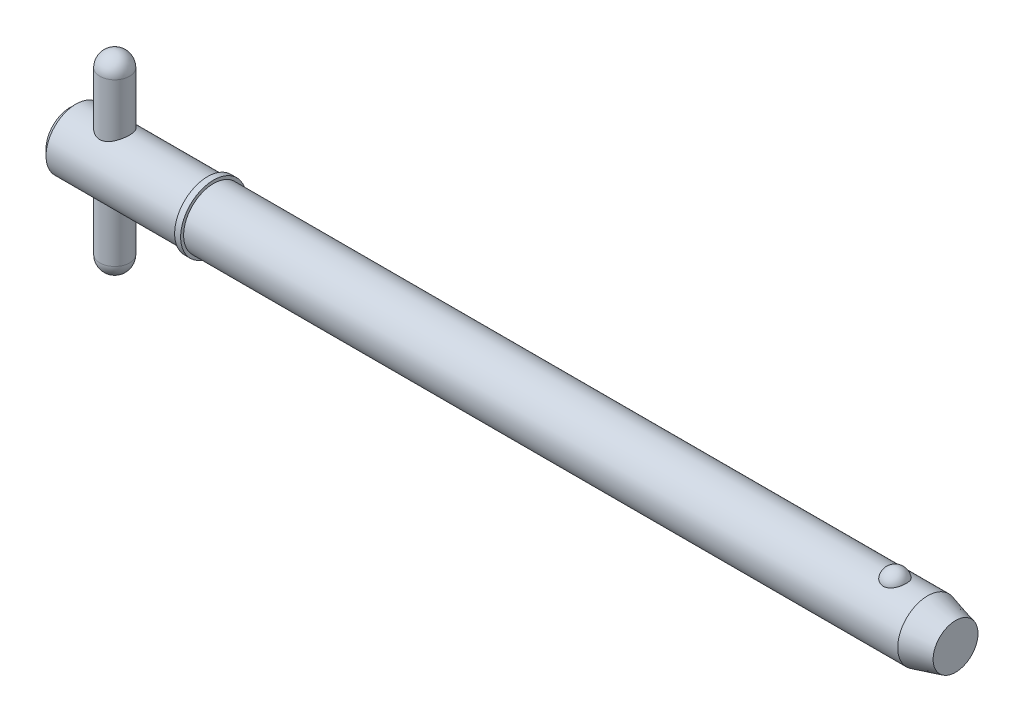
ISO-10303-21;
HEADER;
FILE_DESCRIPTION(('STEP AP214'),'2;1');
FILE_NAME('part.step','',(''),(''),'','','');
FILE_SCHEMA(('AUTOMOTIVE_DESIGN { 1 0 10303 214 1 1 1 1 }'));
ENDSEC;
DATA;
#1=APPLICATION_CONTEXT('core data for automotive mechanical design processes');
#2=APPLICATION_PROTOCOL_DEFINITION('international standard','automotive_design',2000,#1);
#3=PRODUCT_CONTEXT('',#1,'mechanical');
#4=PRODUCT('Part','Part','',(#3));
#5=PRODUCT_RELATED_PRODUCT_CATEGORY('part','',(#4));
#6=PRODUCT_DEFINITION_FORMATION('','',#4);
#7=PRODUCT_DEFINITION_CONTEXT('part definition',#1,'design');
#8=PRODUCT_DEFINITION('design','',#6,#7);
#9=PRODUCT_DEFINITION_SHAPE('','',#8);
#10=(LENGTH_UNIT() NAMED_UNIT(*) SI_UNIT(.MILLI.,.METRE.));
#11=(NAMED_UNIT(*) PLANE_ANGLE_UNIT() SI_UNIT($,.RADIAN.));
#12=(NAMED_UNIT(*) SI_UNIT($,.STERADIAN.) SOLID_ANGLE_UNIT());
#13=UNCERTAINTY_MEASURE_WITH_UNIT(LENGTH_MEASURE(1.E-05),#10,'distance_accuracy_value','');
#14=(GEOMETRIC_REPRESENTATION_CONTEXT(3) GLOBAL_UNCERTAINTY_ASSIGNED_CONTEXT((#13)) GLOBAL_UNIT_ASSIGNED_CONTEXT((#10,
#11,#12)) REPRESENTATION_CONTEXT('',''));
#15=CARTESIAN_POINT('',(0.,0.,0.));
#16=DIRECTION('',(0.,0.,1.));
#17=DIRECTION('',(1.,0.,0.));
#18=AXIS2_PLACEMENT_3D('',#15,#16,#17);
#19=CARTESIAN_POINT('',(5.94,12.7,0.));
#20=DIRECTION('',(0.,-1.,0.));
#21=DIRECTION('',(0.,0.,-1.));
#22=AXIS2_PLACEMENT_3D('',#19,#20,#21);
#23=CYLINDRICAL_SURFACE('',#22,1.98);
#24=CARTESIAN_POINT('',(5.94,-10.72,0.));
#25=DIRECTION('',(0.,-1.,0.));
#26=DIRECTION('',(0.,0.,-1.));
#27=AXIS2_PLACEMENT_3D('',#24,#25,#26);
#28=CIRCLE('',#27,1.98);
#29=CARTESIAN_POINT('',(5.94,-10.72,-1.98));
#30=VERTEX_POINT('',#29);
#31=EDGE_CURVE('P0_E10',#30,#30,#28,.F.);
#32=ORIENTED_EDGE('',*,*,#31,.T.);
#33=EDGE_LOOP('',(#32));
#34=FACE_BOUND('',#33,.T.);
#35=CARTESIAN_POINT('',(5.94,10.72,0.));
#36=DIRECTION('',(0.,-1.,0.));
#37=DIRECTION('',(0.,0.,-1.));
#38=AXIS2_PLACEMENT_3D('',#35,#36,#37);
#39=CIRCLE('',#38,1.98);
#40=CARTESIAN_POINT('',(5.94,10.72,-1.98));
#41=VERTEX_POINT('',#40);
#42=EDGE_CURVE('P0_E21',#41,#41,#39,.T.);
#43=ORIENTED_EDGE('',*,*,#42,.T.);
#44=EDGE_LOOP('',(#43));
#45=FACE_BOUND('',#44,.T.);
#46=ADVANCED_FACE('P0_F14',(#34,#45),#23,.T.);
#47=CARTESIAN_POINT('',(5.94,-10.72,0.));
#48=DIRECTION('',(0.,0.,1.));
#49=DIRECTION('',(1.,0.,0.));
#50=AXIS2_PLACEMENT_3D('',#47,#48,#49);
#51=SPHERICAL_SURFACE('',#50,1.98);
#52=CARTESIAN_POINT('',(5.94,-10.72,0.));
#53=DIRECTION('',(0.,-1.,0.));
#54=DIRECTION('',(0.,0.,-1.));
#55=AXIS2_PLACEMENT_3D('',#52,#53,#54);
#56=SPHERICAL_SURFACE('',#55,1.98);
#57=ORIENTED_EDGE('',*,*,#31,.F.);
#58=EDGE_LOOP('',(#57));
#59=FACE_BOUND('',#58,.T.);
#60=ADVANCED_FACE('P0_F29',(#59),#56,.T.);
#61=CARTESIAN_POINT('',(5.94,10.72,0.));
#62=DIRECTION('',(0.,0.,1.));
#63=DIRECTION('',(1.,0.,0.));
#64=AXIS2_PLACEMENT_3D('',#61,#62,#63);
#65=SPHERICAL_SURFACE('',#64,1.98);
#66=CARTESIAN_POINT('',(5.94,10.72,0.));
#67=DIRECTION('',(0.,-1.,0.));
#68=DIRECTION('',(0.,0.,-1.));
#69=AXIS2_PLACEMENT_3D('',#66,#67,#68);
#70=SPHERICAL_SURFACE('',#69,1.98);
#71=ORIENTED_EDGE('',*,*,#42,.F.);
#72=EDGE_LOOP('',(#71));
#73=FACE_BOUND('',#72,.T.);
#74=ADVANCED_FACE('P0_F16',(#73),#70,.T.);
#75=CLOSED_SHELL('',(#46,#60,#74));
#76=MANIFOLD_SOLID_BREP('P0_B1',#75);
#77=CARTESIAN_POINT('',(0.,0.,0.));
#78=DIRECTION('',(1.,0.,0.));
#79=DIRECTION('',(0.,0.,-1.));
#80=AXIS2_PLACEMENT_3D('',#77,#78,#79);
#81=CYLINDRICAL_SURFACE('',#80,3.97);
#82=CARTESIAN_POINT('',(113.775939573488,0.,0.));
#83=DIRECTION('',(1.,0.,0.));
#84=DIRECTION('',(0.,0.,-1.));
#85=AXIS2_PLACEMENT_3D('',#82,#83,#84);
#86=CIRCLE('',#85,3.97);
#87=CARTESIAN_POINT('',(113.775939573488,0.,-3.97));
#88=VERTEX_POINT('',#87);
#89=EDGE_CURVE('P1_E81',#88,#88,#86,.T.);
#90=ORIENTED_EDGE('',*,*,#89,.F.);
#91=EDGE_LOOP('',(#90));
#92=FACE_BOUND('',#91,.T.);
#93=CARTESIAN_POINT('',(19.05,0.,0.));
#94=DIRECTION('',(1.,0.,0.));
#95=DIRECTION('',(0.,0.,-1.));
#96=AXIS2_PLACEMENT_3D('',#93,#94,#95);
#97=CIRCLE('',#96,3.97);
#98=CARTESIAN_POINT('',(19.05,0.,-3.97));
#99=VERTEX_POINT('',#98);
#100=EDGE_CURVE('P1_E85',#99,#99,#97,.T.);
#101=ORIENTED_EDGE('',*,*,#100,.T.);
#102=EDGE_LOOP('',(#101));
#103=FACE_BOUND('',#102,.T.);
#104=CARTESIAN_POINT('',(109.445192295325,3.65715365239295,1.54470941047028));
#105=CARTESIAN_POINT('',(109.365244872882,3.65716001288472,1.54470290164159));
#106=CARTESIAN_POINT('',(109.285165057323,3.65987074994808,1.53832549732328));
#107=CARTESIAN_POINT('',(109.127237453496,3.6704221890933,1.51297018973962));
#108=CARTESIAN_POINT('',(109.04939614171,3.67827646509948,1.49395894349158));
#109=CARTESIAN_POINT('',(108.898461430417,3.69818848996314,1.44395950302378));
#110=CARTESIAN_POINT('',(108.825356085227,3.71023513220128,1.41300293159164));
#111=CARTESIAN_POINT('',(108.685563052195,3.73721833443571,1.34000212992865));
#112=CARTESIAN_POINT('',(108.618872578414,3.75215363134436,1.2979627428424));
#113=CARTESIAN_POINT('',(108.49148864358,3.78384968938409,1.20248834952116));
#114=CARTESIAN_POINT('',(108.431029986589,3.80065129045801,1.14875388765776));
#115=CARTESIAN_POINT('',(108.319694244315,3.83398532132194,1.03205417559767));
#116=CARTESIAN_POINT('',(108.268820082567,3.85051766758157,0.969086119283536));
#117=CARTESIAN_POINT('',(108.175632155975,3.88238608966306,0.832526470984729));
#118=CARTESIAN_POINT('',(108.133796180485,3.89763698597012,0.758588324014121));
#119=CARTESIAN_POINT('',(108.06251087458,3.92451063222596,0.60435211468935));
#120=CARTESIAN_POINT('',(108.033062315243,3.93613315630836,0.524053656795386));
#121=CARTESIAN_POINT('',(107.986892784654,3.95467606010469,0.358403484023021));
#122=CARTESIAN_POINT('',(107.970312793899,3.96154426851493,0.273006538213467));
#123=CARTESIAN_POINT('',(107.950756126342,3.96967008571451,0.100408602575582));
#124=CARTESIAN_POINT('',(107.947778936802,3.97092790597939,0.0132076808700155));
#125=CARTESIAN_POINT('',(107.955458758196,3.96771794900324,-0.159844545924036));
#126=CARTESIAN_POINT('',(107.966016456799,3.96329187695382,-0.245701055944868));
#127=CARTESIAN_POINT('',(108.00038009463,3.94923163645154,-0.41427746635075));
#128=CARTESIAN_POINT('',(108.024186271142,3.93959737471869,-0.496997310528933));
#129=CARTESIAN_POINT('',(108.08461142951,3.91607752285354,-0.657113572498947));
#130=CARTESIAN_POINT('',(108.121249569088,3.90218558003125,-0.734501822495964));
#131=CARTESIAN_POINT('',(108.206593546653,3.87158287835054,-0.881704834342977));
#132=CARTESIAN_POINT('',(108.255300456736,3.8548718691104,-0.951518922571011));
#133=CARTESIAN_POINT('',(108.364116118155,3.82028735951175,-1.08208159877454));
#134=CARTESIAN_POINT('',(108.424295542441,3.80240713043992,-1.14276958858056));
#135=CARTESIAN_POINT('',(108.554493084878,3.76758161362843,-1.2528243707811));
#136=CARTESIAN_POINT('',(108.624510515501,3.75063626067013,-1.30219195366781));
#137=CARTESIAN_POINT('',(108.77118160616,3.71998948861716,-1.38729709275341));
#138=CARTESIAN_POINT('',(108.847681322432,3.70623183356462,-1.42327904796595));
#139=CARTESIAN_POINT('',(109.006298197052,3.68323188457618,-1.48178996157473));
#140=CARTESIAN_POINT('',(109.0884132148,3.67398788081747,-1.5043240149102));
#141=CARTESIAN_POINT('',(109.251481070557,3.6615216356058,-1.53440939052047));
#142=CARTESIAN_POINT('',(109.332284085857,3.65801951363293,-1.54265826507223));
#143=CARTESIAN_POINT('',(109.49420850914,3.65657341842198,-1.54608423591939));
#144=CARTESIAN_POINT('',(109.575329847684,3.65862829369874,-1.54126404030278));
#145=CARTESIAN_POINT('',(109.732812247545,3.66788969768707,-1.51908474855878));
#146=CARTESIAN_POINT('',(109.809242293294,3.67492621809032,-1.50213925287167));
#147=CARTESIAN_POINT('',(109.958041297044,3.69318404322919,-1.45666982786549));
#148=CARTESIAN_POINT('',(110.030409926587,3.70440568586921,-1.42814496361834));
#149=CARTESIAN_POINT('',(110.170802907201,3.73012749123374,-1.35956319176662));
#150=CARTESIAN_POINT('',(110.238700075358,3.74469307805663,-1.31927107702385));
#151=CARTESIAN_POINT('',(110.366864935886,3.77545272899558,-1.22847440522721));
#152=CARTESIAN_POINT('',(110.427130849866,3.79164717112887,-1.17796747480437));
#153=CARTESIAN_POINT('',(110.541634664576,3.82490325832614,-1.06519260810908));
#154=CARTESIAN_POINT('',(110.595413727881,3.84196735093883,-1.00245914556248));
#155=CARTESIAN_POINT('',(110.692098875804,3.87439863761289,-0.868715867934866));
#156=CARTESIAN_POINT('',(110.735003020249,3.88976552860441,-0.797704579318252));
#157=CARTESIAN_POINT('',(110.810266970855,3.91771381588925,-0.646896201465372));
#158=CARTESIAN_POINT('',(110.84225322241,3.93019255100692,-0.566893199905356));
#159=CARTESIAN_POINT('',(110.893110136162,3.95043886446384,-0.402255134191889));
#160=CARTESIAN_POINT('',(110.911980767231,3.95820643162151,-0.317620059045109));
#161=CARTESIAN_POINT('',(110.93621625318,3.96823733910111,-0.146156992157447));
#162=CARTESIAN_POINT('',(110.941587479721,3.970503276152,-0.0593300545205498));
#163=CARTESIAN_POINT('',(110.938730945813,3.96930811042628,0.114057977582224));
#164=CARTESIAN_POINT('',(110.930503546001,3.9658471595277,0.200619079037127));
#165=CARTESIAN_POINT('',(110.900706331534,3.95358562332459,0.370506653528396));
#166=CARTESIAN_POINT('',(110.87921294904,3.94481563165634,0.453848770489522));
#167=CARTESIAN_POINT('',(110.82338397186,3.92284586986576,0.615497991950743));
#168=CARTESIAN_POINT('',(110.789047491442,3.90964579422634,0.693804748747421));
#169=CARTESIAN_POINT('',(110.707970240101,3.88006987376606,0.843703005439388));
#170=CARTESIAN_POINT('',(110.661153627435,3.86367478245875,0.915249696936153));
#171=CARTESIAN_POINT('',(110.556189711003,3.82949741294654,1.04910810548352));
#172=CARTESIAN_POINT('',(110.498042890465,3.81171519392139,1.11142021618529));
#173=CARTESIAN_POINT('',(110.371743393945,3.77673366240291,1.22503948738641));
#174=CARTESIAN_POINT('',(110.303597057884,3.75953398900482,1.27635357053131));
#175=CARTESIAN_POINT('',(110.158900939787,3.72770506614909,1.36653336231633));
#176=CARTESIAN_POINT('',(110.082348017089,3.71307678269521,1.40539439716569));
#177=CARTESIAN_POINT('',(109.925759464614,3.68864287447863,1.46830480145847));
#178=CARTESIAN_POINT('',(109.845930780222,3.67869017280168,1.49281289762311));
#179=CARTESIAN_POINT('',(109.682987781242,3.66414535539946,1.52817474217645));
#180=CARTESIAN_POINT('',(109.599884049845,3.65953723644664,1.53906926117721));
#181=CARTESIAN_POINT('',(109.492776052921,3.6573894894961,1.54414878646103));
#182=CARTESIAN_POINT('',(109.468990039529,3.65715175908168,1.54471134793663));
#183=CARTESIAN_POINT('',(109.445192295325,3.65715365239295,1.54470941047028));
#184=B_SPLINE_CURVE_WITH_KNOTS('',3,(#104,#105,#106,#107,#108,#109,#110,#111,#112,#113,#114,
#115,#116,#117,#118,#119,#120,#121,#122,#123,#124,#125,#126,#127,#128,#129,#130,#131,#132,#133,
#134,#135,#136,#137,#138,#139,#140,#141,#142,#143,#144,#145,#146,#147,#148,#149,#150,#151,#152,
#153,#154,#155,#156,#157,#158,#159,#160,#161,#162,#163,#164,#165,#166,#167,#168,#169,#170,#171,
#172,#173,#174,#175,#176,#177,#178,#179,#180,#181,#182,#183),.UNSPECIFIED.,.T.,.F.,(4,2,2,2,2,2,
2,2,2,2,2,2,2,2,2,2,2,2,2,2,2,2,2,2,2,2,2,2,2,2,2,2,2,2,2,2,2,2,2,4),(0.,0.239777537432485,
0.480190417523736,0.719971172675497,0.959647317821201,1.20639040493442,1.45320863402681,
1.7109367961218,1.96868099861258,2.22921052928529,2.48973023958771,2.74834928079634,
3.00697295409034,3.26598440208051,3.52501886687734,3.78570385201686,4.04637062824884,
4.30201257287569,4.5575576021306,4.80022994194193,5.04285200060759,5.27757006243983,
5.51230707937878,5.75210128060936,5.99195126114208,6.24392810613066,6.49594987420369,
6.75588818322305,7.01582710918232,7.27564332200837,7.53545264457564,7.79377886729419,
8.0521229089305,8.31207418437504,8.57201437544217,8.83179046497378,9.09166393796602,
9.34270057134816,9.59298357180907,9.66435753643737),.UNSPECIFIED.);
#185=CARTESIAN_POINT('',(109.445192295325,3.65715365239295,1.54470941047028));
#186=VERTEX_POINT('',#185);
#187=EDGE_CURVE('P1_E35',#186,#186,#184,.T.);
#188=ORIENTED_EDGE('',*,*,#187,.T.);
#189=EDGE_LOOP('',(#188));
#190=FACE_BOUND('',#189,.T.);
#191=ADVANCED_FACE('P1_F13',(#92,#103,#190),#81,.T.);
#192=CARTESIAN_POINT('',(0.,0.,0.));
#193=DIRECTION('',(-1.,0.,0.));
#194=DIRECTION('',(0.,0.,1.));
#195=AXIS2_PLACEMENT_3D('',#192,#193,#194);
#196=PLANE('',#195);
#197=CARTESIAN_POINT('',(0.,0.,0.));
#198=DIRECTION('',(1.,0.,0.));
#199=DIRECTION('',(0.,0.,-1.));
#200=AXIS2_PLACEMENT_3D('',#197,#198,#199);
#201=CIRCLE('',#200,3.176);
#202=CARTESIAN_POINT('',(0.,0.,-3.176));
#203=VERTEX_POINT('',#202);
#204=EDGE_CURVE('P1_E9',#203,#203,#201,.T.);
#205=ORIENTED_EDGE('',*,*,#204,.F.);
#206=EDGE_LOOP('',(#205));
#207=FACE_BOUND('',#206,.T.);
#208=ADVANCED_FACE('P1_F15',(#207),#196,.T.);
#209=CARTESIAN_POINT('',(0.793999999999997,0.,0.));
#210=DIRECTION('',(1.,0.,0.));
#211=DIRECTION('',(0.,0.,-1.));
#212=AXIS2_PLACEMENT_3D('',#209,#210,#211);
#213=CONICAL_SURFACE('',#212,3.97,0.78539816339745);
#214=ORIENTED_EDGE('',*,*,#204,.T.);
#215=EDGE_LOOP('',(#214));
#216=FACE_BOUND('',#215,.T.);
#217=CARTESIAN_POINT('',(0.793999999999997,0.,0.));
#218=DIRECTION('',(1.,0.,0.));
#219=DIRECTION('',(0.,0.,-1.));
#220=AXIS2_PLACEMENT_3D('',#217,#218,#219);
#221=CIRCLE('',#220,3.97);
#222=CARTESIAN_POINT('',(0.793999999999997,0.,-3.97));
#223=VERTEX_POINT('',#222);
#224=EDGE_CURVE('P1_E26',#223,#223,#221,.T.);
#225=ORIENTED_EDGE('',*,*,#224,.F.);
#226=EDGE_LOOP('',(#225));
#227=FACE_BOUND('',#226,.T.);
#228=ADVANCED_FACE('P1_F77',(#216,#227),#213,.T.);
#229=CARTESIAN_POINT('',(0.,0.,0.));
#230=DIRECTION('',(1.,0.,0.));
#231=DIRECTION('',(0.,0.,-1.));
#232=AXIS2_PLACEMENT_3D('',#229,#230,#231);
#233=CYLINDRICAL_SURFACE('',#232,3.97);
#234=CARTESIAN_POINT('',(5.94,-3.44100276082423,1.98));
#235=CARTESIAN_POINT('',(5.8367885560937,-3.44101282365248,1.97999171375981));
#236=CARTESIAN_POINT('',(5.73344176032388,-3.44571749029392,1.97187534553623));
#237=CARTESIAN_POINT('',(5.52991905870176,-3.46385873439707,1.93981946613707));
#238=CARTESIAN_POINT('',(5.42975031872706,-3.47731375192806,1.91584653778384));
#239=CARTESIAN_POINT('',(5.23590869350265,-3.51100678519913,1.85336773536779));
#240=CARTESIAN_POINT('',(5.14220446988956,-3.53120882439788,1.81493880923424));
#241=CARTESIAN_POINT('',(4.9625969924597,-3.57606420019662,1.72487335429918));
#242=CARTESIAN_POINT('',(4.87669412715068,-3.6007177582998,1.67323616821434));
#243=CARTESIAN_POINT('',(4.70734412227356,-3.65417020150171,1.55325205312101));
#244=CARTESIAN_POINT('',(4.62467662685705,-3.68314323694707,1.4838818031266));
#245=CARTESIAN_POINT('',(4.47154355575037,-3.74056406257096,1.33252902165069));
#246=CARTESIAN_POINT('',(4.40108404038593,-3.76901158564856,1.25054026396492));
#247=CARTESIAN_POINT('',(4.26974803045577,-3.82445556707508,1.06956584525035));
#248=CARTESIAN_POINT('',(4.20982960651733,-3.8512271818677,0.969809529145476));
#249=CARTESIAN_POINT('',(4.10798077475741,-3.89804342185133,0.760047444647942));
#250=CARTESIAN_POINT('',(4.06603907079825,-3.91809226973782,0.650048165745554));
#251=CARTESIAN_POINT('',(4.00441878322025,-3.94794912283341,0.431181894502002));
#252=CARTESIAN_POINT('',(3.98337329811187,-3.95838209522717,0.322786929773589));
#253=CARTESIAN_POINT('',(3.9596425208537,-3.97016407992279,0.103541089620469));
#254=CARTESIAN_POINT('',(3.95694618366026,-3.97151855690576,-0.00730826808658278));
#255=CARTESIAN_POINT('',(3.9694599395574,-3.96528826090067,-0.218044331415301));
#256=CARTESIAN_POINT('',(3.98314071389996,-3.95846689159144,-0.318049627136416));
#257=CARTESIAN_POINT('',(4.02528522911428,-3.93780347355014,-0.514124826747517));
#258=CARTESIAN_POINT('',(4.05375007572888,-3.92396089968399,-0.61019443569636));
#259=CARTESIAN_POINT('',(4.12484256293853,-3.89028355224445,-0.797351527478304));
#260=CARTESIAN_POINT('',(4.16766142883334,-3.87036821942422,-0.888351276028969));
#261=CARTESIAN_POINT('',(4.26598377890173,-3.82634285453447,-1.06209448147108));
#262=CARTESIAN_POINT('',(4.32149181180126,-3.8022313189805,-1.14483496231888));
#263=CARTESIAN_POINT('',(4.44962332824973,-3.74940011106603,-1.30802500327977));
#264=CARTESIAN_POINT('',(4.52336636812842,-3.72046031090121,-1.38752498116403));
#265=CARTESIAN_POINT('',(4.68287656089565,-3.66269463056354,-1.53354043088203));
#266=CARTESIAN_POINT('',(4.7686527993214,-3.63386885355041,-1.60004599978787));
#267=CARTESIAN_POINT('',(4.9564069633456,-3.57763161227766,-1.72228426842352));
#268=CARTESIAN_POINT('',(5.05906485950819,-3.5504233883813,-1.77707534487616));
#269=CARTESIAN_POINT('',(5.27381412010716,-3.50334038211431,-1.86819784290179));
#270=CARTESIAN_POINT('',(5.38589553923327,-3.48345798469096,-1.90454844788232));
#271=CARTESIAN_POINT('',(5.6069795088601,-3.45548331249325,-1.95481643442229));
#272=CARTESIAN_POINT('',(5.71552407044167,-3.44658268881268,-1.97028113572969));
#273=CARTESIAN_POINT('',(5.93399639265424,-3.43928114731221,-1.98300600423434));
#274=CARTESIAN_POINT('',(6.04392313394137,-3.44087289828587,-1.98027888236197));
#275=CARTESIAN_POINT('',(6.24931618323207,-3.45351901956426,-1.95811780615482));
#276=CARTESIAN_POINT('',(6.34505668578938,-3.46352725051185,-1.94052989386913));
#277=CARTESIAN_POINT('',(6.53204702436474,-3.49033612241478,-1.89188242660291));
#278=CARTESIAN_POINT('',(6.62329540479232,-3.50713894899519,-1.86081853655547));
#279=CARTESIAN_POINT('',(6.80352105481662,-3.54655680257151,-1.78458666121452));
#280=CARTESIAN_POINT('',(6.89219712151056,-3.56940508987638,-1.73883178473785));
#281=CARTESIAN_POINT('',(7.06112449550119,-3.61813012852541,-1.63502913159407));
#282=CARTESIAN_POINT('',(7.14137144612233,-3.6440084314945,-1.57697504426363));
#283=CARTESIAN_POINT('',(7.30168083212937,-3.69977514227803,-1.44171920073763));
#284=CARTESIAN_POINT('',(7.38046039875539,-3.7297597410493,-1.36302972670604));
#285=CARTESIAN_POINT('',(7.52409649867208,-3.78754991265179,-1.19307190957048));
#286=CARTESIAN_POINT('',(7.58894840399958,-3.81535475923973,-1.10179940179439));
#287=CARTESIAN_POINT('',(7.70430122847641,-3.86658972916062,-0.906019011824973));
#288=CARTESIAN_POINT('',(7.75438714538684,-3.88988795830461,-0.801229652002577));
#289=CARTESIAN_POINT('',(7.83572184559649,-3.92848199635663,-0.583216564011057));
#290=CARTESIAN_POINT('',(7.86698708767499,-3.94378479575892,-0.470000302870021));
#291=CARTESIAN_POINT('',(7.90711051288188,-3.96355307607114,-0.249525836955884));
#292=CARTESIAN_POINT('',(7.91775648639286,-3.96888171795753,-0.142669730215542));
#293=CARTESIAN_POINT('',(7.92160247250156,-3.97079858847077,0.0714191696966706));
#294=CARTESIAN_POINT('',(7.91480852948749,-3.96738984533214,0.178651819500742));
#295=CARTESIAN_POINT('',(7.88515479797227,-3.9527181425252,0.383072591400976));
#296=CARTESIAN_POINT('',(7.8633739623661,-3.94198303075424,0.480459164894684));
#297=CARTESIAN_POINT('',(7.80581513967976,-3.91422178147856,0.670038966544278));
#298=CARTESIAN_POINT('',(7.77003513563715,-3.89719473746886,0.762231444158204));
#299=CARTESIAN_POINT('',(7.68389191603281,-3.85747818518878,0.943248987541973));
#300=CARTESIAN_POINT('',(7.63296879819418,-3.83457704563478,1.03175978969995));
#301=CARTESIAN_POINT('',(7.51869140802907,-3.7855122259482,1.19934744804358));
#302=CARTESIAN_POINT('',(7.45533142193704,-3.75934704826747,1.2784199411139));
#303=CARTESIAN_POINT('',(7.31068939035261,-3.70329841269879,1.433144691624));
#304=CARTESIAN_POINT('',(7.22825362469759,-3.67330340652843,1.50768183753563));
#305=CARTESIAN_POINT('',(7.05162367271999,-3.61514025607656,1.64226879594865));
#306=CARTESIAN_POINT('',(6.95741928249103,-3.58697372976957,1.70230590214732));
#307=CARTESIAN_POINT('',(6.75590859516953,-3.53504049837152,1.80775364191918));
#308=CARTESIAN_POINT('',(6.64828786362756,-3.51143624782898,1.85265616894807));
#309=CARTESIAN_POINT('',(6.48137774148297,-3.48289659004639,1.90544537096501));
#310=CARTESIAN_POINT('',(6.42488151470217,-3.4745323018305,1.9206071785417));
#311=CARTESIAN_POINT('',(6.31046920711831,-3.4604244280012,1.94591259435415));
#312=CARTESIAN_POINT('',(6.25255415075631,-3.45467900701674,1.95605971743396));
#313=CARTESIAN_POINT('',(6.1521444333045,-3.44728060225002,1.96905939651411));
#314=CARTESIAN_POINT('',(6.10985721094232,-3.44493297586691,1.97315742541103));
#315=CARTESIAN_POINT('',(6.02505433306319,-3.44179192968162,1.97862952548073));
#316=CARTESIAN_POINT('',(5.98253866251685,-3.44099861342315,1.98000341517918));
#317=CARTESIAN_POINT('',(5.94,-3.44100276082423,1.98));
#318=B_SPLINE_CURVE_WITH_KNOTS('',3,(#234,#235,#236,#237,#238,#239,#240,#241,#242,#243,#244,
#245,#246,#247,#248,#249,#250,#251,#252,#253,#254,#255,#256,#257,#258,#259,#260,#261,#262,#263,
#264,#265,#266,#267,#268,#269,#270,#271,#272,#273,#274,#275,#276,#277,#278,#279,#280,#281,#282,
#283,#284,#285,#286,#287,#288,#289,#290,#291,#292,#293,#294,#295,#296,#297,#298,#299,#300,#301,
#302,#303,#304,#305,#306,#307,#308,#309,#310,#311,#312,#313,#314,#315,#316,#317),.UNSPECIFIED.,
.T.,.F.,(4,2,2,2,2,2,2,2,2,2,2,2,2,2,2,2,2,2,2,2,2,2,2,2,2,2,2,2,2,2,2,2,2,2,2,2,2,2,2,2,2,4),
(0.,0.309462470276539,0.619579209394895,0.928068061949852,1.23657226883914,1.57038619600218,
1.90436536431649,2.26071614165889,2.61684266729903,2.94773555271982,3.27842924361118,
3.58050679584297,3.88260694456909,4.18890317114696,4.49530936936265,4.83057163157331,
5.1660884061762,5.52272472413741,5.87898927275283,6.20706708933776,6.53491569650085,
6.82716910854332,7.11951660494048,7.42541184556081,7.73146442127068,8.07586334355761,
8.42037652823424,8.77380887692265,9.12693169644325,9.44775848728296,9.76847409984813,
10.0682302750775,10.3680296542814,10.6806938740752,10.9935020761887,11.3373031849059,
11.6814044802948,12.0361164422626,12.2131519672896,12.3900632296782,12.5175998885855,
12.6451450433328),.UNSPECIFIED.);
#319=CARTESIAN_POINT('',(5.94,-3.44100276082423,1.98));
#320=VERTEX_POINT('',#319);
#321=EDGE_CURVE('P1_E17',#320,#320,#318,.T.);
#322=ORIENTED_EDGE('',*,*,#321,.F.);
#323=EDGE_LOOP('',(#322));
#324=FACE_BOUND('',#323,.T.);
#325=CARTESIAN_POINT('',(5.94,3.44100276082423,1.98));
#326=CARTESIAN_POINT('',(6.0432114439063,3.44101282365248,1.97999171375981));
#327=CARTESIAN_POINT('',(6.14655823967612,3.44571749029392,1.97187534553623));
#328=CARTESIAN_POINT('',(6.35008094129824,3.46385873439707,1.93981946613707));
#329=CARTESIAN_POINT('',(6.45024968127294,3.47731375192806,1.91584653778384));
#330=CARTESIAN_POINT('',(6.64409130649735,3.51100678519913,1.85336773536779));
#331=CARTESIAN_POINT('',(6.73779553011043,3.53120882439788,1.81493880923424));
#332=CARTESIAN_POINT('',(6.91740300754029,3.57606420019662,1.72487335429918));
#333=CARTESIAN_POINT('',(7.00330587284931,3.6007177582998,1.67323616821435));
#334=CARTESIAN_POINT('',(7.17265587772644,3.65417020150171,1.55325205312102));
#335=CARTESIAN_POINT('',(7.25532337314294,3.68314323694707,1.4838818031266));
#336=CARTESIAN_POINT('',(7.40845644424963,3.74056406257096,1.3325290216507));
#337=CARTESIAN_POINT('',(7.47891595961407,3.76901158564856,1.25054026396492));
#338=CARTESIAN_POINT('',(7.61025196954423,3.82445556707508,1.06956584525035));
#339=CARTESIAN_POINT('',(7.67017039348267,3.8512271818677,0.969809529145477));
#340=CARTESIAN_POINT('',(7.77201922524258,3.89804342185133,0.760047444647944));
#341=CARTESIAN_POINT('',(7.81396092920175,3.91809226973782,0.650048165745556));
#342=CARTESIAN_POINT('',(7.87558121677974,3.94794912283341,0.431181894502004));
#343=CARTESIAN_POINT('',(7.89662670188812,3.95838209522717,0.322786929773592));
#344=CARTESIAN_POINT('',(7.9203574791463,3.97016407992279,0.103541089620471));
#345=CARTESIAN_POINT('',(7.92305381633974,3.97151855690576,-0.00730826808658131));
#346=CARTESIAN_POINT('',(7.9105400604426,3.96528826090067,-0.2180443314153));
#347=CARTESIAN_POINT('',(7.89685928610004,3.95846689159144,-0.318049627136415));
#348=CARTESIAN_POINT('',(7.85471477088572,3.93780347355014,-0.514124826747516));
#349=CARTESIAN_POINT('',(7.82624992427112,3.92396089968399,-0.61019443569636));
#350=CARTESIAN_POINT('',(7.75515743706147,3.89028355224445,-0.797351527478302));
#351=CARTESIAN_POINT('',(7.71233857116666,3.87036821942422,-0.888351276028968));
#352=CARTESIAN_POINT('',(7.61401622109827,3.82634285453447,-1.06209448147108));
#353=CARTESIAN_POINT('',(7.55850818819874,3.8022313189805,-1.14483496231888));
#354=CARTESIAN_POINT('',(7.43037667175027,3.74940011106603,-1.30802500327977));
#355=CARTESIAN_POINT('',(7.35663363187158,3.72046031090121,-1.38752498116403));
#356=CARTESIAN_POINT('',(7.19712343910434,3.66269463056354,-1.53354043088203));
#357=CARTESIAN_POINT('',(7.1113472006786,3.63386885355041,-1.60004599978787));
#358=CARTESIAN_POINT('',(6.9235930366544,3.57763161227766,-1.72228426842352));
#359=CARTESIAN_POINT('',(6.82093514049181,3.5504233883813,-1.77707534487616));
#360=CARTESIAN_POINT('',(6.60618587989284,3.50334038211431,-1.86819784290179));
#361=CARTESIAN_POINT('',(6.49410446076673,3.48345798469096,-1.90454844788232));
#362=CARTESIAN_POINT('',(6.2730204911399,3.45548331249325,-1.95481643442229));
#363=CARTESIAN_POINT('',(6.16447592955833,3.44658268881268,-1.97028113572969));
#364=CARTESIAN_POINT('',(5.94600360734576,3.43928114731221,-1.98300600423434));
#365=CARTESIAN_POINT('',(5.83607686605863,3.44087289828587,-1.98027888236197));
#366=CARTESIAN_POINT('',(5.63068381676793,3.45351901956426,-1.95811780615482));
#367=CARTESIAN_POINT('',(5.53494331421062,3.46352725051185,-1.94052989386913));
#368=CARTESIAN_POINT('',(5.34795297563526,3.49033612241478,-1.89188242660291));
#369=CARTESIAN_POINT('',(5.25670459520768,3.50713894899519,-1.86081853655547));
#370=CARTESIAN_POINT('',(5.07647894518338,3.54655680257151,-1.78458666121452));
#371=CARTESIAN_POINT('',(4.98780287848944,3.56940508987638,-1.73883178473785));
#372=CARTESIAN_POINT('',(4.81887550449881,3.61813012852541,-1.63502913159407));
#373=CARTESIAN_POINT('',(4.73862855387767,3.6440084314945,-1.57697504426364));
#374=CARTESIAN_POINT('',(4.57831916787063,3.69977514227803,-1.44171920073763));
#375=CARTESIAN_POINT('',(4.49953960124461,3.7297597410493,-1.36302972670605));
#376=CARTESIAN_POINT('',(4.35590350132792,3.78754991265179,-1.19307190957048));
#377=CARTESIAN_POINT('',(4.29105159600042,3.81535475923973,-1.10179940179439));
#378=CARTESIAN_POINT('',(4.17569877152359,3.86658972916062,-0.906019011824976));
#379=CARTESIAN_POINT('',(4.12561285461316,3.88988795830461,-0.80122965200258));
#380=CARTESIAN_POINT('',(4.04427815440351,3.92848199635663,-0.58321656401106));
#381=CARTESIAN_POINT('',(4.01301291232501,3.94378479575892,-0.470000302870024));
#382=CARTESIAN_POINT('',(3.97288948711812,3.96355307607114,-0.249525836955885));
#383=CARTESIAN_POINT('',(3.96224351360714,3.96888171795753,-0.142669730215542));
#384=CARTESIAN_POINT('',(3.95839752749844,3.97079858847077,0.0714191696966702));
#385=CARTESIAN_POINT('',(3.96519147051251,3.96738984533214,0.178651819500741));
#386=CARTESIAN_POINT('',(3.99484520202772,3.9527181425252,0.383072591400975));
#387=CARTESIAN_POINT('',(4.01662603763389,3.94198303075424,0.480459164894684));
#388=CARTESIAN_POINT('',(4.07418486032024,3.91422178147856,0.670038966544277));
#389=CARTESIAN_POINT('',(4.10996486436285,3.89719473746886,0.762231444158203));
#390=CARTESIAN_POINT('',(4.19610808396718,3.85747818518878,0.943248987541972));
#391=CARTESIAN_POINT('',(4.24703120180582,3.83457704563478,1.03175978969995));
#392=CARTESIAN_POINT('',(4.36130859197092,3.7855122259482,1.19934744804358));
#393=CARTESIAN_POINT('',(4.42466857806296,3.75934704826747,1.2784199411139));
#394=CARTESIAN_POINT('',(4.56931060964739,3.70329841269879,1.433144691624));
#395=CARTESIAN_POINT('',(4.65174637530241,3.67330340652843,1.50768183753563));
#396=CARTESIAN_POINT('',(4.82837632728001,3.61514025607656,1.64226879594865));
#397=CARTESIAN_POINT('',(4.92258071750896,3.58697372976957,1.70230590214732));
#398=CARTESIAN_POINT('',(5.12409140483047,3.53504049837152,1.80775364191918));
#399=CARTESIAN_POINT('',(5.23171213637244,3.51143624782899,1.85265616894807));
#400=CARTESIAN_POINT('',(5.39862225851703,3.48289659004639,1.90544537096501));
#401=CARTESIAN_POINT('',(5.45511848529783,3.4745323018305,1.9206071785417));
#402=CARTESIAN_POINT('',(5.56953079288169,3.4604244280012,1.94591259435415));
#403=CARTESIAN_POINT('',(5.62744584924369,3.45467900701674,1.95605971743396));
#404=CARTESIAN_POINT('',(5.7278555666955,3.44728060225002,1.9690593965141));
#405=CARTESIAN_POINT('',(5.77014278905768,3.44493297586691,1.97315742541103));
#406=CARTESIAN_POINT('',(5.85494566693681,3.44179192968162,1.97862952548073));
#407=CARTESIAN_POINT('',(5.89746133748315,3.44099861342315,1.98000341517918));
#408=CARTESIAN_POINT('',(5.94,3.44100276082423,1.98));
#409=B_SPLINE_CURVE_WITH_KNOTS('',3,(#325,#326,#327,#328,#329,#330,#331,#332,#333,#334,#335,
#336,#337,#338,#339,#340,#341,#342,#343,#344,#345,#346,#347,#348,#349,#350,#351,#352,#353,#354,
#355,#356,#357,#358,#359,#360,#361,#362,#363,#364,#365,#366,#367,#368,#369,#370,#371,#372,#373,
#374,#375,#376,#377,#378,#379,#380,#381,#382,#383,#384,#385,#386,#387,#388,#389,#390,#391,#392,
#393,#394,#395,#396,#397,#398,#399,#400,#401,#402,#403,#404,#405,#406,#407,#408),.UNSPECIFIED.,
.T.,.F.,(4,2,2,2,2,2,2,2,2,2,2,2,2,2,2,2,2,2,2,2,2,2,2,2,2,2,2,2,2,2,2,2,2,2,2,2,2,2,2,2,2,4),
(0.,0.309462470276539,0.619579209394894,0.928068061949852,1.23657226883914,1.57038619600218,
1.90436536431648,2.26071614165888,2.61684266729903,2.94773555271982,3.27842924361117,
3.58050679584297,3.88260694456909,4.18890317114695,4.49530936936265,4.83057163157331,
5.1660884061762,5.5227247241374,5.87898927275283,6.20706708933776,6.53491569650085,
6.82716910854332,7.11951660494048,7.42541184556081,7.73146442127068,8.07586334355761,
8.42037652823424,8.77380887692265,9.12693169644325,9.44775848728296,9.76847409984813,
10.0682302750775,10.3680296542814,10.6806938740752,10.9935020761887,11.3373031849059,
11.6814044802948,12.0361164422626,12.2131519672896,12.3900632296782,12.5175998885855,
12.6451450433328),.UNSPECIFIED.);
#410=CARTESIAN_POINT('',(5.94,3.44100276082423,1.98));
#411=VERTEX_POINT('',#410);
#412=EDGE_CURVE('P1_E43',#411,#411,#409,.T.);
#413=ORIENTED_EDGE('',*,*,#412,.F.);
#414=EDGE_LOOP('',(#413));
#415=FACE_BOUND('',#414,.T.);
#416=ORIENTED_EDGE('',*,*,#224,.T.);
#417=EDGE_LOOP('',(#416));
#418=FACE_BOUND('',#417,.T.);
#419=CARTESIAN_POINT('',(18.256,0.,0.));
#420=DIRECTION('',(1.,0.,0.));
#421=DIRECTION('',(0.,0.,-1.));
#422=AXIS2_PLACEMENT_3D('',#419,#420,#421);
#423=CIRCLE('',#422,3.97);
#424=CARTESIAN_POINT('',(18.256,0.,-3.97));
#425=VERTEX_POINT('',#424);
#426=EDGE_CURVE('P1_E31',#425,#425,#423,.T.);
#427=ORIENTED_EDGE('',*,*,#426,.F.);
#428=EDGE_LOOP('',(#427));
#429=FACE_BOUND('',#428,.T.);
#430=ADVANCED_FACE('P1_F103',(#324,#415,#418,#429),#233,.T.);
#431=CARTESIAN_POINT('',(18.256,3.97,0.));
#432=DIRECTION('',(-1.,0.,0.));
#433=DIRECTION('',(0.,0.,1.));
#434=AXIS2_PLACEMENT_3D('',#431,#432,#433);
#435=PLANE('',#434);
#436=ORIENTED_EDGE('',*,*,#426,.T.);
#437=EDGE_LOOP('',(#436));
#438=FACE_BOUND('',#437,.T.);
#439=CARTESIAN_POINT('',(18.256,0.,0.));
#440=DIRECTION('',(1.,0.,0.));
#441=DIRECTION('',(0.,0.,-1.));
#442=AXIS2_PLACEMENT_3D('',#439,#440,#441);
#443=CIRCLE('',#442,4.367);
#444=CARTESIAN_POINT('',(18.256,0.,-4.367));
#445=VERTEX_POINT('',#444);
#446=EDGE_CURVE('P1_E91',#445,#445,#443,.T.);
#447=ORIENTED_EDGE('',*,*,#446,.F.);
#448=EDGE_LOOP('',(#447));
#449=FACE_BOUND('',#448,.T.);
#450=ADVANCED_FACE('P1_F100',(#438,#449),#435,.T.);
#451=CARTESIAN_POINT('',(0.,0.,0.));
#452=DIRECTION('',(1.,0.,0.));
#453=DIRECTION('',(0.,0.,-1.));
#454=AXIS2_PLACEMENT_3D('',#451,#452,#453);
#455=CYLINDRICAL_SURFACE('',#454,4.367);
#456=ORIENTED_EDGE('',*,*,#446,.T.);
#457=EDGE_LOOP('',(#456));
#458=FACE_BOUND('',#457,.T.);
#459=CARTESIAN_POINT('',(19.05,0.,0.));
#460=DIRECTION('',(1.,0.,0.));
#461=DIRECTION('',(0.,0.,-1.));
#462=AXIS2_PLACEMENT_3D('',#459,#460,#461);
#463=CIRCLE('',#462,4.367);
#464=CARTESIAN_POINT('',(19.05,0.,-4.367));
#465=VERTEX_POINT('',#464);
#466=EDGE_CURVE('P1_E88',#465,#465,#463,.T.);
#467=ORIENTED_EDGE('',*,*,#466,.F.);
#468=EDGE_LOOP('',(#467));
#469=FACE_BOUND('',#468,.T.);
#470=ADVANCED_FACE('P1_F68',(#458,#469),#455,.T.);
#471=CARTESIAN_POINT('',(19.05,4.367,0.));
#472=DIRECTION('',(1.,0.,0.));
#473=DIRECTION('',(0.,0.,-1.));
#474=AXIS2_PLACEMENT_3D('',#471,#472,#473);
#475=PLANE('',#474);
#476=ORIENTED_EDGE('',*,*,#466,.T.);
#477=EDGE_LOOP('',(#476));
#478=FACE_BOUND('',#477,.T.);
#479=ORIENTED_EDGE('',*,*,#100,.F.);
#480=EDGE_LOOP('',(#479));
#481=FACE_BOUND('',#480,.T.);
#482=ADVANCED_FACE('P1_F62',(#478,#481),#475,.T.);
#483=CARTESIAN_POINT('',(117.48,0.,0.));
#484=DIRECTION('',(-1.,0.,0.));
#485=DIRECTION('',(0.,0.,1.));
#486=AXIS2_PLACEMENT_3D('',#483,#484,#485);
#487=CONICAL_SURFACE('',#486,2.97750000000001,0.26179938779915);
#488=ORIENTED_EDGE('',*,*,#89,.T.);
#489=EDGE_LOOP('',(#488));
#490=FACE_BOUND('',#489,.T.);
#491=CARTESIAN_POINT('',(117.48,0.,0.));
#492=DIRECTION('',(1.,0.,0.));
#493=DIRECTION('',(0.,0.,-1.));
#494=AXIS2_PLACEMENT_3D('',#491,#492,#493);
#495=CIRCLE('',#494,2.97750000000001);
#496=CARTESIAN_POINT('',(117.48,0.,-2.97750000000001));
#497=VERTEX_POINT('',#496);
#498=EDGE_CURVE('P1_E42',#497,#497,#495,.T.);
#499=ORIENTED_EDGE('',*,*,#498,.F.);
#500=EDGE_LOOP('',(#499));
#501=FACE_BOUND('',#500,.T.);
#502=ADVANCED_FACE('P1_F59',(#490,#501),#487,.T.);
#503=CARTESIAN_POINT('',(117.48,2.97750000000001,0.));
#504=DIRECTION('',(1.,0.,0.));
#505=DIRECTION('',(0.,0.,-1.));
#506=AXIS2_PLACEMENT_3D('',#503,#504,#505);
#507=PLANE('',#506);
#508=ORIENTED_EDGE('',*,*,#498,.T.);
#509=EDGE_LOOP('',(#508));
#510=FACE_BOUND('',#509,.T.);
#511=ADVANCED_FACE('P1_F55',(#510),#507,.T.);
#512=CARTESIAN_POINT('',(109.445192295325,3.573,0.));
#513=DIRECTION('',(-1.,0.,0.));
#514=DIRECTION('',(0.,-1.,0.));
#515=AXIS2_PLACEMENT_3D('',#512,#513,#514);
#516=SPHERICAL_SURFACE('',#515,1.54699999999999);
#517=ORIENTED_EDGE('',*,*,#187,.F.);
#518=EDGE_LOOP('',(#517));
#519=FACE_BOUND('',#518,.T.);
#520=ADVANCED_FACE('P1_F50',(#519),#516,.T.);
#521=CARTESIAN_POINT('',(5.94,-4.367,0.));
#522=DIRECTION('',(0.,1.,0.));
#523=DIRECTION('',(0.,0.,1.));
#524=AXIS2_PLACEMENT_3D('',#521,#522,#523);
#525=CYLINDRICAL_SURFACE('',#524,1.98);
#526=ORIENTED_EDGE('',*,*,#321,.T.);
#527=EDGE_LOOP('',(#526));
#528=FACE_BOUND('',#527,.T.);
#529=ORIENTED_EDGE('',*,*,#412,.T.);
#530=EDGE_LOOP('',(#529));
#531=FACE_BOUND('',#530,.T.);
#532=ADVANCED_FACE('P1_F54',(#528,#531),#525,.F.);
#533=CLOSED_SHELL('',(#191,#208,#228,#430,#450,#470,#482,#502,#511,#520,#532));
#534=MANIFOLD_SOLID_BREP('P1_B1',#533);
#535=ADVANCED_BREP_SHAPE_REPRESENTATION('',(#18,#76,#534),#14);
#536=SHAPE_DEFINITION_REPRESENTATION(#9,#535);
ENDSEC;
END-ISO-10303-21;
